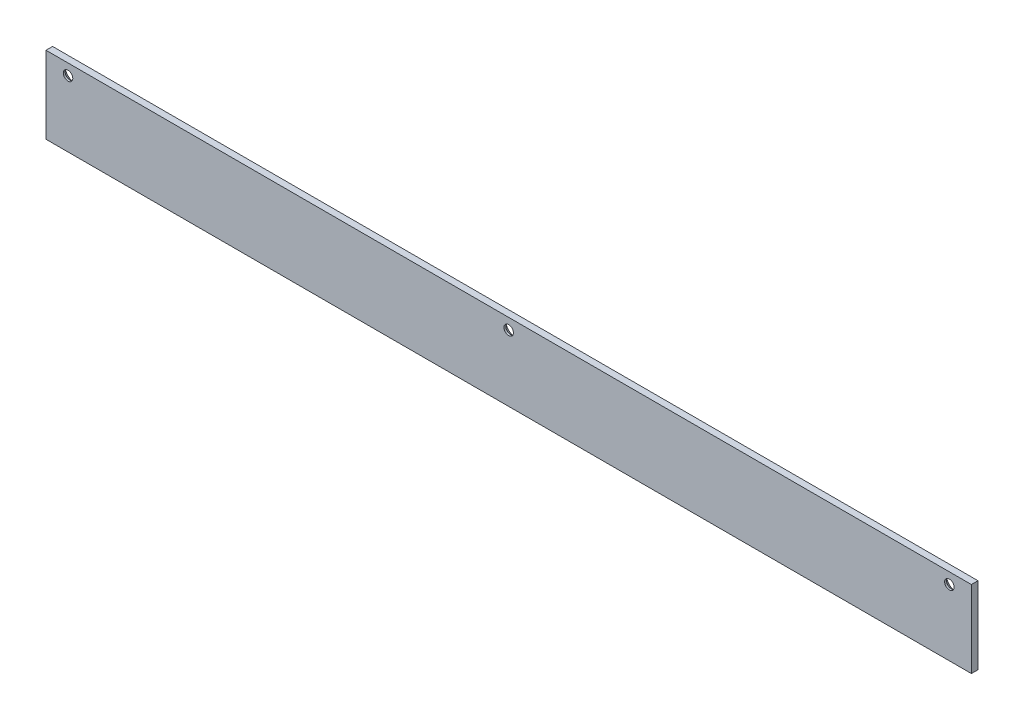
ISO-10303-21;
HEADER;
FILE_DESCRIPTION(('STEP AP214'),'2;1');
FILE_NAME('part.step','',(''),(''),'','','');
FILE_SCHEMA(('AUTOMOTIVE_DESIGN { 1 0 10303 214 1 1 1 1 }'));
ENDSEC;
DATA;
#1=APPLICATION_CONTEXT('core data for automotive mechanical design processes');
#2=APPLICATION_PROTOCOL_DEFINITION('international standard','automotive_design',2000,#1);
#3=PRODUCT_CONTEXT('',#1,'mechanical');
#4=PRODUCT('Part','Part','',(#3));
#5=PRODUCT_RELATED_PRODUCT_CATEGORY('part','',(#4));
#6=PRODUCT_DEFINITION_FORMATION('','',#4);
#7=PRODUCT_DEFINITION_CONTEXT('part definition',#1,'design');
#8=PRODUCT_DEFINITION('design','',#6,#7);
#9=PRODUCT_DEFINITION_SHAPE('','',#8);
#10=(LENGTH_UNIT() NAMED_UNIT(*) SI_UNIT(.MILLI.,.METRE.));
#11=(NAMED_UNIT(*) PLANE_ANGLE_UNIT() SI_UNIT($,.RADIAN.));
#12=(NAMED_UNIT(*) SI_UNIT($,.STERADIAN.) SOLID_ANGLE_UNIT());
#13=UNCERTAINTY_MEASURE_WITH_UNIT(LENGTH_MEASURE(1.E-05),#10,'distance_accuracy_value','');
#14=(GEOMETRIC_REPRESENTATION_CONTEXT(3) GLOBAL_UNCERTAINTY_ASSIGNED_CONTEXT((#13)) GLOBAL_UNIT_ASSIGNED_CONTEXT((#10,
#11,#12)) REPRESENTATION_CONTEXT('',''));
#15=CARTESIAN_POINT('',(0.,0.,0.));
#16=DIRECTION('',(0.,0.,1.));
#17=DIRECTION('',(1.,0.,0.));
#18=AXIS2_PLACEMENT_3D('',#15,#16,#17);
#19=CARTESIAN_POINT('',(2.22044604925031E-13,-1.11022302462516E-13,2.99999999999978));
#20=DIRECTION('',(1.,0.,0.));
#21=DIRECTION('',(0.,0.,-1.00000000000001));
#22=AXIS2_PLACEMENT_3D('',#19,#20,#21);
#23=PLANE('',#22);
#24=DIRECTION('',(0.,-1.,0.));
#25=VECTOR('',#24,1.);
#26=CARTESIAN_POINT('',(0.,0.,0.));
#27=LINE('',#26,#25);
#28=CARTESIAN_POINT('',(-3.33066907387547E-13,35.,-1.11022302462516E-13));
#29=VERTEX_POINT('',#28);
#30=CARTESIAN_POINT('',(0.,0.,0.));
#31=VERTEX_POINT('',#30);
#32=EDGE_CURVE('E100',#29,#31,#27,.T.);
#33=ORIENTED_EDGE('',*,*,#32,.T.);
#34=DIRECTION('',(0.,0.,-1.00000000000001));
#35=VECTOR('',#34,1.);
#36=CARTESIAN_POINT('',(2.22044604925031E-13,-1.11022302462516E-13,2.99999999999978));
#37=LINE('',#36,#35);
#38=CARTESIAN_POINT('',(2.22044604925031E-13,-1.11022302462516E-13,2.99999999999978));
#39=VERTEX_POINT('',#38);
#40=EDGE_CURVE('E11',#39,#31,#37,.T.);
#41=ORIENTED_EDGE('',*,*,#40,.F.);
#42=DIRECTION('',(0.,-1.,0.));
#43=VECTOR('',#42,1.);
#44=CARTESIAN_POINT('',(2.22044604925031E-13,-1.11022302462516E-13,2.99999999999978));
#45=LINE('',#44,#43);
#46=CARTESIAN_POINT('',(0.,34.9999999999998,2.99999999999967));
#47=VERTEX_POINT('',#46);
#48=EDGE_CURVE('E88',#47,#39,#45,.T.);
#49=ORIENTED_EDGE('',*,*,#48,.F.);
#50=DIRECTION('',(0.,0.,-1.00000000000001));
#51=VECTOR('',#50,1.);
#52=CARTESIAN_POINT('',(0.,34.9999999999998,2.99999999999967));
#53=LINE('',#52,#51);
#54=EDGE_CURVE('E96',#47,#29,#53,.T.);
#55=ORIENTED_EDGE('',*,*,#54,.T.);
#56=EDGE_LOOP('',(#33,#41,#49,#55));
#57=FACE_BOUND('',#56,.T.);
#58=ADVANCED_FACE('F36',(#57),#23,.F.);
#59=CARTESIAN_POINT('',(2.22044604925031E-13,-1.11022302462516E-13,2.99999999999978));
#60=DIRECTION('',(0.,1.,0.));
#61=DIRECTION('',(0.,0.,1.00000000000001));
#62=AXIS2_PLACEMENT_3D('',#59,#60,#61);
#63=PLANE('',#62);
#64=DIRECTION('',(1.,0.,0.));
#65=VECTOR('',#64,1.);
#66=CARTESIAN_POINT('',(0.,0.,0.));
#67=LINE('',#66,#65);
#68=CARTESIAN_POINT('',(420.,-3.05311331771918E-13,0.));
#69=VERTEX_POINT('',#68);
#70=EDGE_CURVE('E92',#31,#69,#67,.T.);
#71=ORIENTED_EDGE('',*,*,#70,.T.);
#72=DIRECTION('',(0.,0.,-1.00000000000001));
#73=VECTOR('',#72,1.);
#74=CARTESIAN_POINT('',(420.,0.,3.));
#75=LINE('',#74,#73);
#76=CARTESIAN_POINT('',(420.,0.,3.));
#77=VERTEX_POINT('',#76);
#78=EDGE_CURVE('E45',#77,#69,#75,.T.);
#79=ORIENTED_EDGE('',*,*,#78,.F.);
#80=DIRECTION('',(1.,0.,0.));
#81=VECTOR('',#80,1.);
#82=CARTESIAN_POINT('',(2.22044604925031E-13,-1.11022302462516E-13,2.99999999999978));
#83=LINE('',#82,#81);
#84=EDGE_CURVE('E83',#39,#77,#83,.T.);
#85=ORIENTED_EDGE('',*,*,#84,.F.);
#86=ORIENTED_EDGE('',*,*,#40,.T.);
#87=EDGE_LOOP('',(#71,#79,#85,#86));
#88=FACE_BOUND('',#87,.T.);
#89=ADVANCED_FACE('F91',(#88),#63,.F.);
#90=CARTESIAN_POINT('',(420.,0.,3.));
#91=DIRECTION('',(-1.,0.,0.));
#92=DIRECTION('',(0.,0.,1.00000000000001));
#93=AXIS2_PLACEMENT_3D('',#90,#91,#92);
#94=PLANE('',#93);
#95=DIRECTION('',(0.,1.,0.));
#96=VECTOR('',#95,1.);
#97=CARTESIAN_POINT('',(420.,-3.05311331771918E-13,0.));
#98=LINE('',#97,#96);
#99=CARTESIAN_POINT('',(420.,34.9999999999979,7.7715611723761E-13));
#100=VERTEX_POINT('',#99);
#101=EDGE_CURVE('E70',#69,#100,#98,.T.);
#102=ORIENTED_EDGE('',*,*,#101,.T.);
#103=DIRECTION('',(0.,0.,-1.00000000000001));
#104=VECTOR('',#103,1.);
#105=CARTESIAN_POINT('',(419.999999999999,34.9999999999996,2.99999999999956));
#106=LINE('',#105,#104);
#107=CARTESIAN_POINT('',(419.999999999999,34.9999999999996,2.99999999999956));
#108=VERTEX_POINT('',#107);
#109=EDGE_CURVE('E93',#108,#100,#106,.T.);
#110=ORIENTED_EDGE('',*,*,#109,.F.);
#111=DIRECTION('',(0.,1.,0.));
#112=VECTOR('',#111,1.);
#113=CARTESIAN_POINT('',(420.,0.,3.));
#114=LINE('',#113,#112);
#115=EDGE_CURVE('E86',#77,#108,#114,.T.);
#116=ORIENTED_EDGE('',*,*,#115,.F.);
#117=ORIENTED_EDGE('',*,*,#78,.T.);
#118=EDGE_LOOP('',(#102,#110,#116,#117));
#119=FACE_BOUND('',#118,.T.);
#120=ADVANCED_FACE('F94',(#119),#94,.F.);
#121=CARTESIAN_POINT('',(0.,34.9999999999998,2.99999999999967));
#122=DIRECTION('',(0.,-1.,0.));
#123=DIRECTION('',(0.,0.,-1.00000000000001));
#124=AXIS2_PLACEMENT_3D('',#121,#122,#123);
#125=PLANE('',#124);
#126=DIRECTION('',(-1.,0.,0.));
#127=VECTOR('',#126,1.);
#128=CARTESIAN_POINT('',(-3.33066907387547E-13,35.,-1.11022302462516E-13));
#129=LINE('',#128,#127);
#130=EDGE_CURVE('E76',#100,#29,#129,.T.);
#131=ORIENTED_EDGE('',*,*,#130,.T.);
#132=ORIENTED_EDGE('',*,*,#54,.F.);
#133=DIRECTION('',(-1.,0.,0.));
#134=VECTOR('',#133,1.);
#135=CARTESIAN_POINT('',(0.,34.9999999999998,2.99999999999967));
#136=LINE('',#135,#134);
#137=EDGE_CURVE('E53',#108,#47,#136,.T.);
#138=ORIENTED_EDGE('',*,*,#137,.F.);
#139=ORIENTED_EDGE('',*,*,#109,.T.);
#140=EDGE_LOOP('',(#131,#132,#138,#139));
#141=FACE_BOUND('',#140,.T.);
#142=ADVANCED_FACE('F108',(#141),#125,.F.);
#143=CARTESIAN_POINT('',(2.22044604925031E-13,-1.11022302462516E-13,2.99999999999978));
#144=DIRECTION('',(0.,0.,-1.00000000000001));
#145=DIRECTION('',(-1.,0.,0.));
#146=AXIS2_PLACEMENT_3D('',#143,#144,#145);
#147=PLANE('',#146);
#148=CARTESIAN_POINT('',(10.0000000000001,30.,2.99999999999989));
#149=DIRECTION('',(0.,0.,-1.00000000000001));
#150=DIRECTION('',(-1.,0.,0.));
#151=AXIS2_PLACEMENT_3D('',#148,#149,#150);
#152=CIRCLE('',#151,2.15);
#153=CARTESIAN_POINT('',(7.85000000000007,30.,2.99999999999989));
#154=VERTEX_POINT('',#153);
#155=EDGE_CURVE('E132',#154,#154,#152,.T.);
#156=ORIENTED_EDGE('',*,*,#155,.T.);
#157=EDGE_LOOP('',(#156));
#158=FACE_BOUND('',#157,.T.);
#159=CARTESIAN_POINT('',(210.,29.9999999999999,3.00000000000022));
#160=DIRECTION('',(0.,0.,-1.00000000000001));
#161=DIRECTION('',(-1.,0.,0.));
#162=AXIS2_PLACEMENT_3D('',#159,#160,#161);
#163=CIRCLE('',#162,2.14999999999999);
#164=CARTESIAN_POINT('',(207.85,29.9999999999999,3.00000000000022));
#165=VERTEX_POINT('',#164);
#166=EDGE_CURVE('E126',#165,#165,#163,.T.);
#167=ORIENTED_EDGE('',*,*,#166,.T.);
#168=EDGE_LOOP('',(#167));
#169=FACE_BOUND('',#168,.T.);
#170=CARTESIAN_POINT('',(410.,29.9999999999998,3.00000000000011));
#171=DIRECTION('',(0.,0.,-1.00000000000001));
#172=DIRECTION('',(-1.,0.,0.));
#173=AXIS2_PLACEMENT_3D('',#170,#171,#172);
#174=CIRCLE('',#173,2.15000000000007);
#175=CARTESIAN_POINT('',(407.85,29.9999999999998,3.00000000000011));
#176=VERTEX_POINT('',#175);
#177=EDGE_CURVE('E118',#176,#176,#174,.T.);
#178=ORIENTED_EDGE('',*,*,#177,.T.);
#179=EDGE_LOOP('',(#178));
#180=FACE_BOUND('',#179,.T.);
#181=ORIENTED_EDGE('',*,*,#48,.T.);
#182=ORIENTED_EDGE('',*,*,#84,.T.);
#183=ORIENTED_EDGE('',*,*,#115,.T.);
#184=ORIENTED_EDGE('',*,*,#137,.T.);
#185=EDGE_LOOP('',(#181,#182,#183,#184));
#186=FACE_BOUND('',#185,.T.);
#187=ADVANCED_FACE('F84',(#158,#169,#180,#186),#147,.F.);
#188=CARTESIAN_POINT('',(0.,0.,0.));
#189=DIRECTION('',(0.,0.,-1.00000000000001));
#190=DIRECTION('',(-1.,0.,0.));
#191=AXIS2_PLACEMENT_3D('',#188,#189,#190);
#192=PLANE('',#191);
#193=CARTESIAN_POINT('',(409.999999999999,29.9999999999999,-1.11022302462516E-13));
#194=DIRECTION('',(0.,0.,-1.00000000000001));
#195=DIRECTION('',(-1.,0.,0.));
#196=AXIS2_PLACEMENT_3D('',#193,#194,#195);
#197=CIRCLE('',#196,4.30000000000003);
#198=CARTESIAN_POINT('',(405.699999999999,29.9999999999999,-1.12335141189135E-13));
#199=VERTEX_POINT('',#198);
#200=EDGE_CURVE('E103',#199,#199,#197,.T.);
#201=ORIENTED_EDGE('',*,*,#200,.F.);
#202=EDGE_LOOP('',(#201));
#203=FACE_BOUND('',#202,.T.);
#204=CARTESIAN_POINT('',(210.,30.,-2.22044604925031E-13));
#205=DIRECTION('',(0.,0.,-1.00000000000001));
#206=DIRECTION('',(-1.,0.,0.));
#207=AXIS2_PLACEMENT_3D('',#204,#205,#206);
#208=CIRCLE('',#207,4.3);
#209=CARTESIAN_POINT('',(205.7,30.,-2.23357443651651E-13));
#210=VERTEX_POINT('',#209);
#211=EDGE_CURVE('E117',#210,#210,#208,.T.);
#212=ORIENTED_EDGE('',*,*,#211,.F.);
#213=EDGE_LOOP('',(#212));
#214=FACE_BOUND('',#213,.T.);
#215=CARTESIAN_POINT('',(10.,29.9999999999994,1.11022302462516E-13));
#216=DIRECTION('',(0.,0.,-1.00000000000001));
#217=DIRECTION('',(-1.,0.,0.));
#218=AXIS2_PLACEMENT_3D('',#215,#216,#217);
#219=CIRCLE('',#218,4.3);
#220=CARTESIAN_POINT('',(5.70000000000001,29.9999999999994,1.09709463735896E-13));
#221=VERTEX_POINT('',#220);
#222=EDGE_CURVE('E114',#221,#221,#219,.T.);
#223=ORIENTED_EDGE('',*,*,#222,.F.);
#224=EDGE_LOOP('',(#223));
#225=FACE_BOUND('',#224,.T.);
#226=ORIENTED_EDGE('',*,*,#32,.F.);
#227=ORIENTED_EDGE('',*,*,#130,.F.);
#228=ORIENTED_EDGE('',*,*,#101,.F.);
#229=ORIENTED_EDGE('',*,*,#70,.F.);
#230=EDGE_LOOP('',(#226,#227,#228,#229));
#231=FACE_BOUND('',#230,.T.);
#232=ADVANCED_FACE('F111',(#203,#214,#225,#231),#192,.T.);
#233=CARTESIAN_POINT('',(10.,29.9999999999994,1.11022302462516E-13));
#234=DIRECTION('',(0.,0.,-1.00000000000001));
#235=DIRECTION('',(-1.,0.,0.));
#236=AXIS2_PLACEMENT_3D('',#233,#234,#235);
#237=CONICAL_SURFACE('',#236,4.3,0.78539816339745);
#238=CARTESIAN_POINT('',(10.0000000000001,30.0000000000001,2.14999999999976));
#239=DIRECTION('',(0.,0.,-1.00000000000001));
#240=DIRECTION('',(-1.,0.,0.));
#241=AXIS2_PLACEMENT_3D('',#238,#239,#240);
#242=CIRCLE('',#241,2.15);
#243=CARTESIAN_POINT('',(7.85000000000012,30.0000000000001,2.14999999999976));
#244=VERTEX_POINT('',#243);
#245=EDGE_CURVE('E135',#244,#244,#242,.T.);
#246=ORIENTED_EDGE('',*,*,#245,.F.);
#247=EDGE_LOOP('',(#246));
#248=FACE_BOUND('',#247,.T.);
#249=ORIENTED_EDGE('',*,*,#222,.T.);
#250=EDGE_LOOP('',(#249));
#251=FACE_BOUND('',#250,.T.);
#252=ADVANCED_FACE('F150',(#248,#251),#237,.F.);
#253=CARTESIAN_POINT('',(210.,30.,-2.22044604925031E-13));
#254=DIRECTION('',(0.,0.,-1.00000000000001));
#255=DIRECTION('',(-1.,0.,0.));
#256=AXIS2_PLACEMENT_3D('',#253,#254,#255);
#257=CONICAL_SURFACE('',#256,4.3,0.78539816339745);
#258=CARTESIAN_POINT('',(210.,29.9999999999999,2.15000000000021));
#259=DIRECTION('',(0.,0.,-1.00000000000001));
#260=DIRECTION('',(-1.,0.,0.));
#261=AXIS2_PLACEMENT_3D('',#258,#259,#260);
#262=CIRCLE('',#261,2.14999999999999);
#263=CARTESIAN_POINT('',(207.85,29.9999999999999,2.15000000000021));
#264=VERTEX_POINT('',#263);
#265=EDGE_CURVE('E129',#264,#264,#262,.T.);
#266=ORIENTED_EDGE('',*,*,#265,.F.);
#267=EDGE_LOOP('',(#266));
#268=FACE_BOUND('',#267,.T.);
#269=ORIENTED_EDGE('',*,*,#211,.T.);
#270=EDGE_LOOP('',(#269));
#271=FACE_BOUND('',#270,.T.);
#272=ADVANCED_FACE('F153',(#268,#271),#257,.F.);
#273=CARTESIAN_POINT('',(409.999999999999,29.9999999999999,-1.11022302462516E-13));
#274=DIRECTION('',(0.,0.,-1.00000000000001));
#275=DIRECTION('',(-1.,0.,0.));
#276=AXIS2_PLACEMENT_3D('',#273,#274,#275);
#277=CONICAL_SURFACE('',#276,4.30000000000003,0.78539816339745);
#278=CARTESIAN_POINT('',(409.999999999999,29.9999999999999,2.15000000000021));
#279=DIRECTION('',(0.,0.,-1.00000000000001));
#280=DIRECTION('',(-1.,0.,0.));
#281=AXIS2_PLACEMENT_3D('',#278,#279,#280);
#282=CIRCLE('',#281,2.15000000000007);
#283=CARTESIAN_POINT('',(407.849999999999,29.9999999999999,2.15000000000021));
#284=VERTEX_POINT('',#283);
#285=EDGE_CURVE('E123',#284,#284,#282,.T.);
#286=ORIENTED_EDGE('',*,*,#285,.F.);
#287=EDGE_LOOP('',(#286));
#288=FACE_BOUND('',#287,.T.);
#289=ORIENTED_EDGE('',*,*,#200,.T.);
#290=EDGE_LOOP('',(#289));
#291=FACE_BOUND('',#290,.T.);
#292=ADVANCED_FACE('F38',(#288,#291),#277,.F.);
#293=CARTESIAN_POINT('',(410.,29.9999999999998,3.00000000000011));
#294=DIRECTION('',(0.,0.,-1.00000000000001));
#295=DIRECTION('',(-1.,0.,0.));
#296=AXIS2_PLACEMENT_3D('',#293,#294,#295);
#297=CYLINDRICAL_SURFACE('',#296,2.15000000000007);
#298=ORIENTED_EDGE('',*,*,#177,.F.);
#299=EDGE_LOOP('',(#298));
#300=FACE_BOUND('',#299,.T.);
#301=ORIENTED_EDGE('',*,*,#285,.T.);
#302=EDGE_LOOP('',(#301));
#303=FACE_BOUND('',#302,.T.);
#304=ADVANCED_FACE('F179',(#300,#303),#297,.F.);
#305=CARTESIAN_POINT('',(210.,29.9999999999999,3.00000000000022));
#306=DIRECTION('',(0.,0.,-1.00000000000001));
#307=DIRECTION('',(-1.,0.,0.));
#308=AXIS2_PLACEMENT_3D('',#305,#306,#307);
#309=CYLINDRICAL_SURFACE('',#308,2.14999999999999);
#310=ORIENTED_EDGE('',*,*,#166,.F.);
#311=EDGE_LOOP('',(#310));
#312=FACE_BOUND('',#311,.T.);
#313=ORIENTED_EDGE('',*,*,#265,.T.);
#314=EDGE_LOOP('',(#313));
#315=FACE_BOUND('',#314,.T.);
#316=ADVANCED_FACE('F146',(#312,#315),#309,.F.);
#317=CARTESIAN_POINT('',(10.0000000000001,30.,2.99999999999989));
#318=DIRECTION('',(0.,0.,-1.00000000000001));
#319=DIRECTION('',(-1.,0.,0.));
#320=AXIS2_PLACEMENT_3D('',#317,#318,#319);
#321=CYLINDRICAL_SURFACE('',#320,2.15);
#322=ORIENTED_EDGE('',*,*,#155,.F.);
#323=EDGE_LOOP('',(#322));
#324=FACE_BOUND('',#323,.T.);
#325=ORIENTED_EDGE('',*,*,#245,.T.);
#326=EDGE_LOOP('',(#325));
#327=FACE_BOUND('',#326,.T.);
#328=ADVANCED_FACE('F143',(#324,#327),#321,.F.);
#329=CLOSED_SHELL('',(#58,#89,#120,#142,#187,#232,#252,#272,#292,#304,#316,#328));
#330=MANIFOLD_SOLID_BREP('B2',#329);
#331=ADVANCED_BREP_SHAPE_REPRESENTATION('',(#18,#330),#14);
#332=SHAPE_DEFINITION_REPRESENTATION(#9,#331);
ENDSEC;
END-ISO-10303-21;
